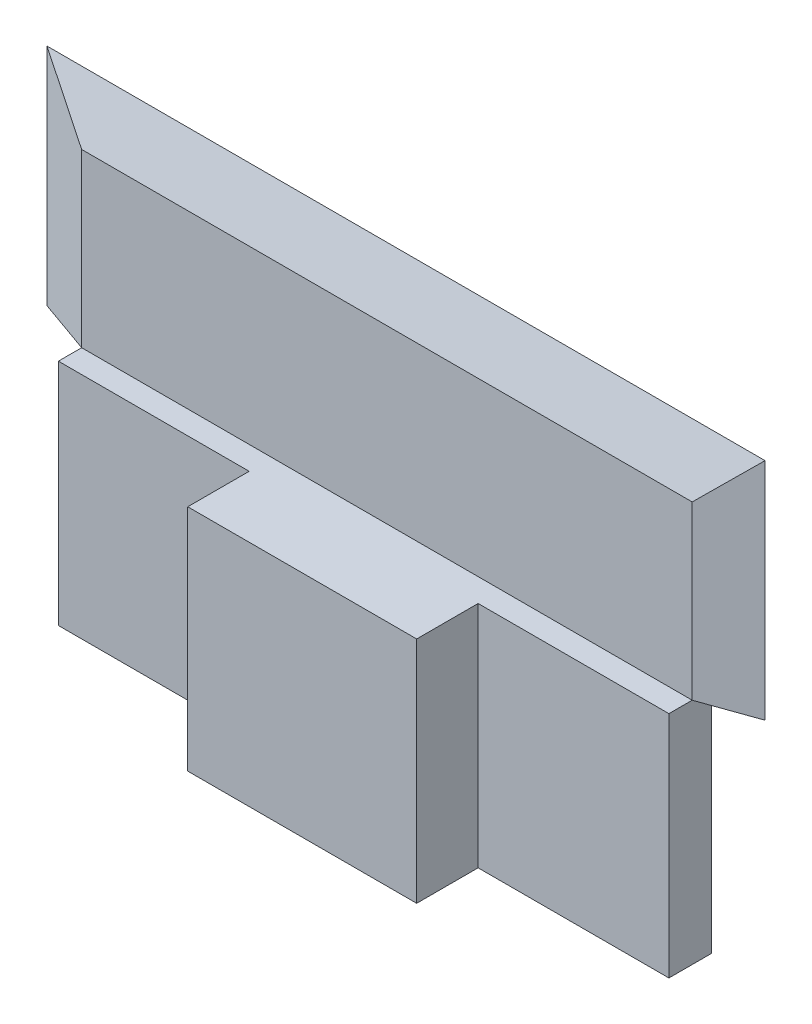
from build123d import *

# Parameters (mm, degrees)
SKETCH1_W           = 81.28
SKETCH1_H           = 60.96
BOSS_EXTRUDE1_DEPTH = 11.2776
SKETCH2_W           = 30.48
SKETCH2_H           = 60.96
BOSS_EXTRUDE2_DEPTH = 16.3576


with BuildPart() as part:
    # Sketch1 → Boss-Extrude1 (new body)
    with BuildSketch(Plane.XY):
        with Locations((40.64, 30.48)):
            Rectangle(SKETCH1_W, SKETCH1_H)
    boss_extrude1 = extrude(amount=BOSS_EXTRUDE1_DEPTH)

    # Sketch2 → Boss-Extrude2 (add)
    with BuildSketch(Plane.XY.offset(11.2776)):
        with Locations((15.24, 30.48)):
            Rectangle(SKETCH2_W, SKETCH2_H)
    boss_extrude2 = extrude(amount=BOSS_EXTRUDE2_DEPTH)

    # Sketch4 → Loft4 section 0
    with BuildSketch(Plane.XY.offset(5.08)):
        with BuildLine():
            Line((0, 60.96), (81.28, 60.96))
            Line((81.28, 60.96), (81.28, 106.68))
            Line((81.28, 106.68), (0, 106.68))
            Line((0, 106.68), (0, 60.96))
        make_face()
    # Sketch3 → Loft4 section 1
    with BuildSketch(Plane(origin=(0, 0, 0), x_dir=(-1, 0, 0), z_dir=(0, 0, -1))):
        with BuildLine():
            Line((0, 60.96), (-95.6056, 60.96))
            Line((-95.6056, 60.96), (-95.6056, 120.8278))
            Line((-95.6056, 120.8278), (0, 120.8278))
            Line((0, 120.8278), (0, 60.96))
        make_face()
    loft4 = loft()

    # Mirror2: Boss-Extrude1, Boss-Extrude2, Loft4 across plane
    add(boss_extrude1.mirror(Plane(origin=(0, 0, 11.2776), x_dir=(0, 0, 1), z_dir=(1, 0, 0))))
    add(boss_extrude2.mirror(Plane(origin=(0, 0, 11.2776), x_dir=(0, 0, 1), z_dir=(1, 0, 0))))
    add(loft4.mirror(Plane(origin=(0, 0, 11.2776), x_dir=(0, 0, 1), z_dir=(1, 0, 0))))


solid = part.part
